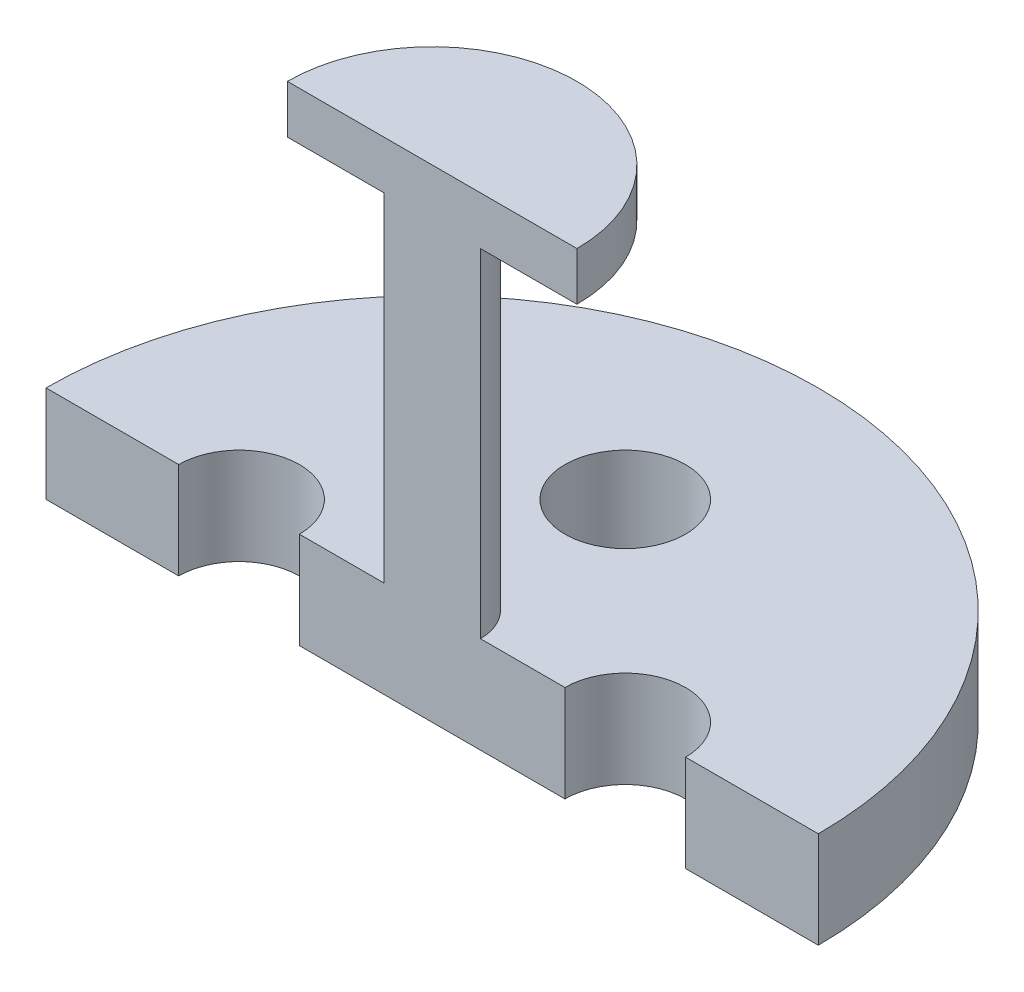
from build123d import *

# Parameters (mm, degrees)
ENL_V_MAT_EXTRU_2_REACH      = 17.1
ESQUISSE3_R                  = 1.25
R_P_TITION_CIRCULAIRE1_COUNT = 4
ESQUISSE2_W                  = 16
ESQUISSE2_H                  = 8
COUPE_DEPTH                  = 16.099668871


with BuildPart() as part:
    # Esquisse1 → R_volution1 (revolve)
    with BuildSketch(Plane.XY):
        Polygon((0, 10), (-3, 10), (-3, 9), (-1, 9), (-1, 2), (-8, 2), (-8, 0), (0, 0), align=None)
    revolve(axis=Axis((0, 71.591026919, 0), (0, -1, 0)))

    # Esquisse3 → Enl_v. mat.-Extru.2 (cut, up to next)
    with BuildSketch(Plane.XZ, mode=Mode.PRIVATE) as enl_v_mat_extru_2_sk1:
        with Locations((4, 0)):
            Circle(ESQUISSE3_R)
    enl_v_mat_extru_2_tool1 = extrude(enl_v_mat_extru_2_sk1.sketch, amount=-ENL_V_MAT_EXTRU_2_REACH, mode=Mode.PRIVATE) & part.part
    enl_v_mat_extru_2 = enl_v_mat_extru_2_tool1.solids().sort_by_distance((4, 0, 0))[0]
    add(enl_v_mat_extru_2, mode=Mode.SUBTRACT)

    # R_p_tition circulaire1: Enl_v. mat.-Extru.2 ×4 about axis
    r_p_tition_circulaire1_axis = Axis((0, 2, 0), (0, 1, 0))
    for i in range(1, R_P_TITION_CIRCULAIRE1_COUNT):
        add(enl_v_mat_extru_2.rotate(r_p_tition_circulaire1_axis, i * 360 / R_P_TITION_CIRCULAIRE1_COUNT), mode=Mode.SUBTRACT)

    # Esquisse2 → Coupe (cut, through all)
    with BuildSketch(Plane(origin=(0, 10, 0), x_dir=(-1, 0, 0), z_dir=(0, 1, 0))):
        with Locations((0, 4)):
            Rectangle(ESQUISSE2_W, ESQUISSE2_H)
    extrude(amount=-COUPE_DEPTH, mode=Mode.SUBTRACT)


solid = part.part
